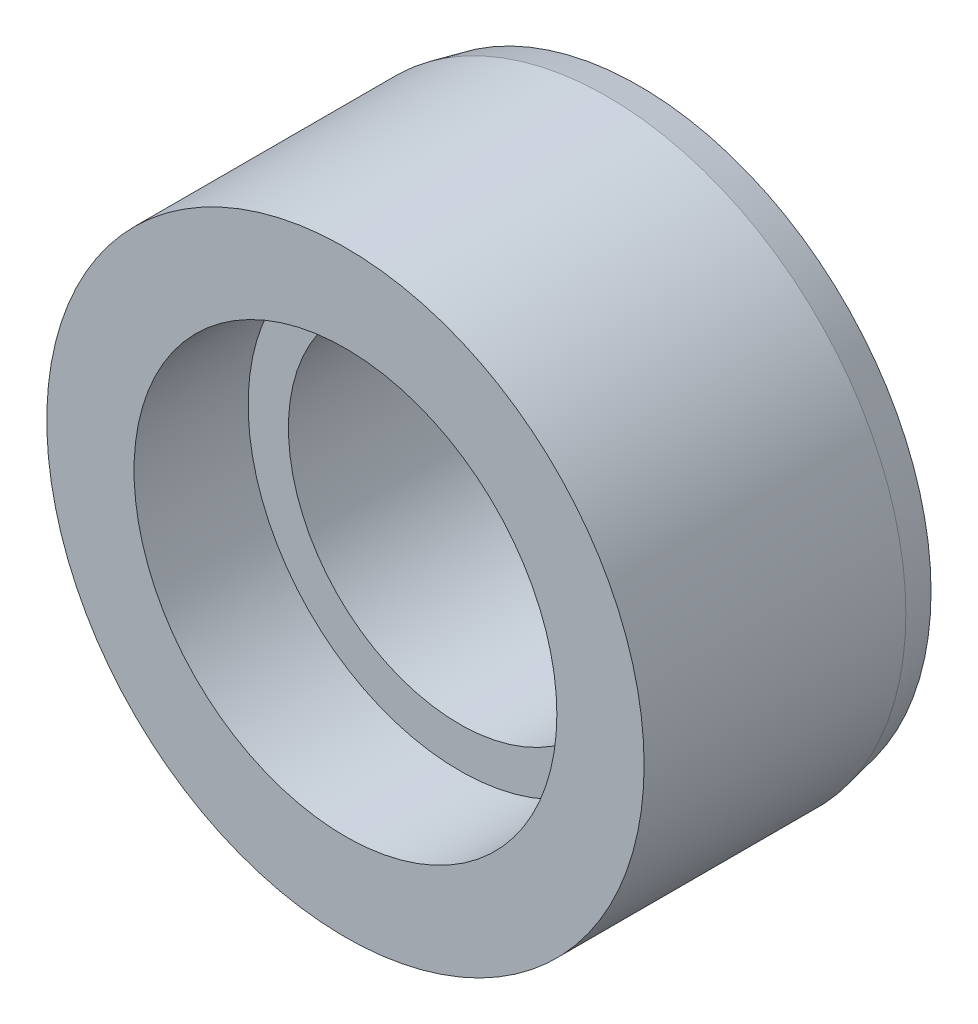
ISO-10303-21;
HEADER;
FILE_DESCRIPTION(('STEP AP214'),'2;1');
FILE_NAME('part.step','',(''),(''),'','','');
FILE_SCHEMA(('AUTOMOTIVE_DESIGN { 1 0 10303 214 1 1 1 1 }'));
ENDSEC;
DATA;
#1=APPLICATION_CONTEXT('core data for automotive mechanical design processes');
#2=APPLICATION_PROTOCOL_DEFINITION('international standard','automotive_design',2000,#1);
#3=PRODUCT_CONTEXT('',#1,'mechanical');
#4=PRODUCT('Part','Part','',(#3));
#5=PRODUCT_RELATED_PRODUCT_CATEGORY('part','',(#4));
#6=PRODUCT_DEFINITION_FORMATION('','',#4);
#7=PRODUCT_DEFINITION_CONTEXT('part definition',#1,'design');
#8=PRODUCT_DEFINITION('design','',#6,#7);
#9=PRODUCT_DEFINITION_SHAPE('','',#8);
#10=(LENGTH_UNIT() NAMED_UNIT(*) SI_UNIT(.MILLI.,.METRE.));
#11=(NAMED_UNIT(*) PLANE_ANGLE_UNIT() SI_UNIT($,.RADIAN.));
#12=(NAMED_UNIT(*) SI_UNIT($,.STERADIAN.) SOLID_ANGLE_UNIT());
#13=UNCERTAINTY_MEASURE_WITH_UNIT(LENGTH_MEASURE(1.E-05),#10,'distance_accuracy_value','');
#14=(GEOMETRIC_REPRESENTATION_CONTEXT(3) GLOBAL_UNCERTAINTY_ASSIGNED_CONTEXT((#13)) GLOBAL_UNIT_ASSIGNED_CONTEXT((#10,
#11,#12)) REPRESENTATION_CONTEXT('',''));
#15=CARTESIAN_POINT('',(0.,0.,0.));
#16=DIRECTION('',(0.,0.,1.));
#17=DIRECTION('',(1.,0.,0.));
#18=AXIS2_PLACEMENT_3D('',#15,#16,#17);
#19=CARTESIAN_POINT('',(0.,8.001,0.));
#20=DIRECTION('',(0.,0.,-1.));
#21=DIRECTION('',(-1.,0.,0.));
#22=AXIS2_PLACEMENT_3D('',#19,#20,#21);
#23=PLANE('',#22);
#24=CARTESIAN_POINT('',(0.,0.,0.));
#25=DIRECTION('',(0.,0.,1.));
#26=DIRECTION('',(1.,0.,0.));
#27=AXIS2_PLACEMENT_3D('',#24,#25,#26);
#28=CIRCLE('',#27,8.001);
#29=CARTESIAN_POINT('',(8.001,0.,0.));
#30=VERTEX_POINT('',#29);
#31=EDGE_CURVE('E56',#30,#30,#28,.T.);
#32=ORIENTED_EDGE('',*,*,#31,.F.);
#33=EDGE_LOOP('',(#32));
#34=FACE_BOUND('',#33,.T.);
#35=CARTESIAN_POINT('',(0.,0.,0.));
#36=DIRECTION('',(0.,0.,1.));
#37=DIRECTION('',(1.,0.,0.));
#38=AXIS2_PLACEMENT_3D('',#35,#36,#37);
#39=CIRCLE('',#38,11.303);
#40=CARTESIAN_POINT('',(11.303,0.,0.));
#41=VERTEX_POINT('',#40);
#42=EDGE_CURVE('E10',#41,#41,#39,.T.);
#43=ORIENTED_EDGE('',*,*,#42,.T.);
#44=EDGE_LOOP('',(#43));
#45=FACE_BOUND('',#44,.T.);
#46=ADVANCED_FACE('F31',(#34,#45),#23,.F.);
#47=CARTESIAN_POINT('',(0.,0.,0.));
#48=DIRECTION('',(0.,0.,1.));
#49=DIRECTION('',(1.,0.,0.));
#50=AXIS2_PLACEMENT_3D('',#47,#48,#49);
#51=CYLINDRICAL_SURFACE('',#50,11.303);
#52=ORIENTED_EDGE('',*,*,#42,.F.);
#53=EDGE_LOOP('',(#52));
#54=FACE_BOUND('',#53,.T.);
#55=CARTESIAN_POINT('',(0.,0.,-9.906));
#56=DIRECTION('',(0.,0.,1.));
#57=DIRECTION('',(1.,0.,0.));
#58=AXIS2_PLACEMENT_3D('',#55,#56,#57);
#59=CIRCLE('',#58,11.303);
#60=CARTESIAN_POINT('',(11.303,0.,-9.906));
#61=VERTEX_POINT('',#60);
#62=EDGE_CURVE('E37',#61,#61,#59,.T.);
#63=ORIENTED_EDGE('',*,*,#62,.T.);
#64=EDGE_LOOP('',(#63));
#65=FACE_BOUND('',#64,.T.);
#66=ADVANCED_FACE('F63',(#54,#65),#51,.T.);
#67=CARTESIAN_POINT('',(0.,0.,-11.1125));
#68=DIRECTION('',(0.,0.,1.));
#69=DIRECTION('',(1.,0.,0.));
#70=AXIS2_PLACEMENT_3D('',#67,#68,#69);
#71=CONICAL_SURFACE('',#70,11.049,0.207496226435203);
#72=ORIENTED_EDGE('',*,*,#62,.F.);
#73=EDGE_LOOP('',(#72));
#74=FACE_BOUND('',#73,.T.);
#75=CARTESIAN_POINT('',(0.,0.,-11.1125));
#76=DIRECTION('',(0.,0.,1.));
#77=DIRECTION('',(1.,0.,0.));
#78=AXIS2_PLACEMENT_3D('',#75,#76,#77);
#79=CIRCLE('',#78,11.049);
#80=CARTESIAN_POINT('',(11.049,0.,-11.1125));
#81=VERTEX_POINT('',#80);
#82=EDGE_CURVE('E41',#81,#81,#79,.T.);
#83=ORIENTED_EDGE('',*,*,#82,.T.);
#84=EDGE_LOOP('',(#83));
#85=FACE_BOUND('',#84,.T.);
#86=ADVANCED_FACE('F67',(#74,#85),#71,.T.);
#87=CARTESIAN_POINT('',(0.,11.049,-11.1125));
#88=DIRECTION('',(0.,0.,1.));
#89=DIRECTION('',(1.,0.,0.));
#90=AXIS2_PLACEMENT_3D('',#87,#88,#89);
#91=PLANE('',#90);
#92=ORIENTED_EDGE('',*,*,#82,.F.);
#93=EDGE_LOOP('',(#92));
#94=FACE_BOUND('',#93,.T.);
#95=CARTESIAN_POINT('',(0.,0.,-11.1125));
#96=DIRECTION('',(0.,0.,1.));
#97=DIRECTION('',(1.,0.,0.));
#98=AXIS2_PLACEMENT_3D('',#95,#96,#97);
#99=CIRCLE('',#98,6.477);
#100=CARTESIAN_POINT('',(6.477,0.,-11.1125));
#101=VERTEX_POINT('',#100);
#102=EDGE_CURVE('E45',#101,#101,#99,.T.);
#103=ORIENTED_EDGE('',*,*,#102,.T.);
#104=EDGE_LOOP('',(#103));
#105=FACE_BOUND('',#104,.T.);
#106=ADVANCED_FACE('F72',(#94,#105),#91,.F.);
#107=CARTESIAN_POINT('',(0.,0.,0.));
#108=DIRECTION('',(0.,0.,1.));
#109=DIRECTION('',(1.,0.,0.));
#110=AXIS2_PLACEMENT_3D('',#107,#108,#109);
#111=CYLINDRICAL_SURFACE('',#110,6.477);
#112=ORIENTED_EDGE('',*,*,#102,.F.);
#113=EDGE_LOOP('',(#112));
#114=FACE_BOUND('',#113,.T.);
#115=CARTESIAN_POINT('',(0.,0.,-4.318));
#116=DIRECTION('',(0.,0.,1.));
#117=DIRECTION('',(1.,0.,0.));
#118=AXIS2_PLACEMENT_3D('',#115,#116,#117);
#119=CIRCLE('',#118,6.477);
#120=CARTESIAN_POINT('',(6.477,0.,-4.318));
#121=VERTEX_POINT('',#120);
#122=EDGE_CURVE('E50',#121,#121,#119,.T.);
#123=ORIENTED_EDGE('',*,*,#122,.T.);
#124=EDGE_LOOP('',(#123));
#125=FACE_BOUND('',#124,.T.);
#126=ADVANCED_FACE('F78',(#114,#125),#111,.F.);
#127=CARTESIAN_POINT('',(0.,6.477,-4.318));
#128=DIRECTION('',(0.,0.,-1.));
#129=DIRECTION('',(-1.,0.,0.));
#130=AXIS2_PLACEMENT_3D('',#127,#128,#129);
#131=PLANE('',#130);
#132=ORIENTED_EDGE('',*,*,#122,.F.);
#133=EDGE_LOOP('',(#132));
#134=FACE_BOUND('',#133,.T.);
#135=CARTESIAN_POINT('',(0.,0.,-4.318));
#136=DIRECTION('',(0.,0.,1.));
#137=DIRECTION('',(1.,0.,0.));
#138=AXIS2_PLACEMENT_3D('',#135,#136,#137);
#139=CIRCLE('',#138,8.001);
#140=CARTESIAN_POINT('',(8.001,0.,-4.318));
#141=VERTEX_POINT('',#140);
#142=EDGE_CURVE('E53',#141,#141,#139,.T.);
#143=ORIENTED_EDGE('',*,*,#142,.T.);
#144=EDGE_LOOP('',(#143));
#145=FACE_BOUND('',#144,.T.);
#146=ADVANCED_FACE('F82',(#134,#145),#131,.F.);
#147=CARTESIAN_POINT('',(0.,0.,0.));
#148=DIRECTION('',(0.,0.,1.));
#149=DIRECTION('',(1.,0.,0.));
#150=AXIS2_PLACEMENT_3D('',#147,#148,#149);
#151=CYLINDRICAL_SURFACE('',#150,8.001);
#152=ORIENTED_EDGE('',*,*,#142,.F.);
#153=EDGE_LOOP('',(#152));
#154=FACE_BOUND('',#153,.T.);
#155=ORIENTED_EDGE('',*,*,#31,.T.);
#156=EDGE_LOOP('',(#155));
#157=FACE_BOUND('',#156,.T.);
#158=ADVANCED_FACE('F60',(#154,#157),#151,.F.);
#159=CLOSED_SHELL('',(#46,#66,#86,#106,#126,#146,#158));
#160=MANIFOLD_SOLID_BREP('B2',#159);
#161=ADVANCED_BREP_SHAPE_REPRESENTATION('',(#18,#160),#14);
#162=SHAPE_DEFINITION_REPRESENTATION(#9,#161);
ENDSEC;
END-ISO-10303-21;
